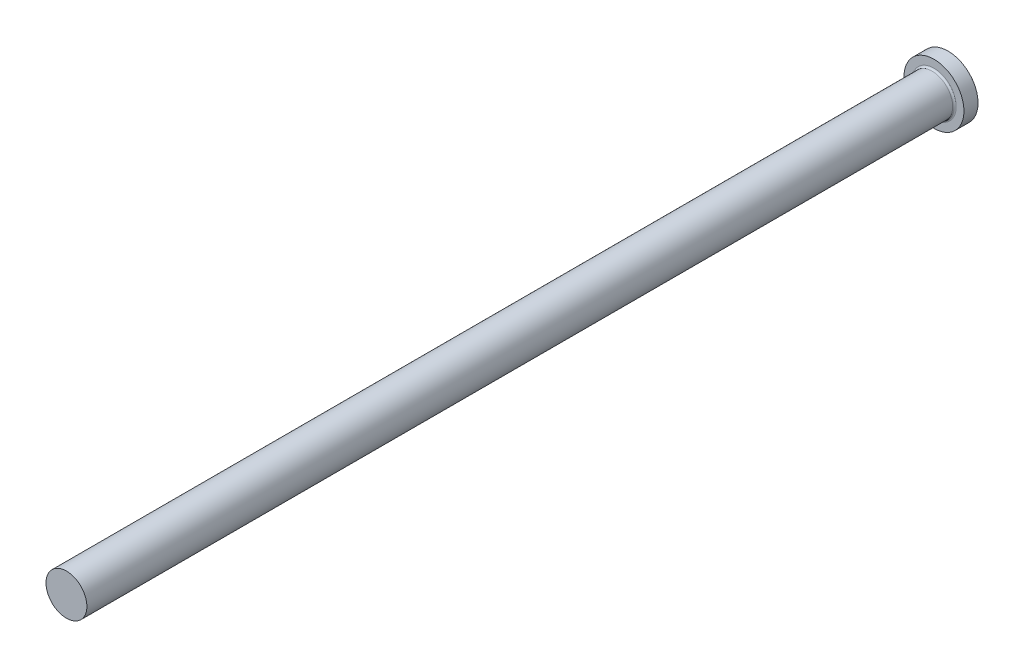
from build123d import *

# Parameters (mm, degrees)
FILLET1_R = 0.5


with BuildPart() as part:
    # FV → Revolve1 (revolve)
    with BuildSketch(Plane(origin=(0, 0, 0), x_dir=(1, 0, 0), z_dir=(0, 1, 0)), mode=Mode.PRIVATE) as revolve1_sk:
        Polygon((0, 0), (8.5, 0), (8.5, -4), (5.8, -4), (5.8, -250), (0, -250), align=None)
    revolve(revolve1_sk.sketch.rotate(Axis((0, 0, -9.033228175), (0, 0, 1)), 180), axis=Axis((0, 0, -9.033228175), (0, 0, 1)))

    # Fillet1
    fillet1_edges = [part.edges().sort_by_distance(p)[0] for p in [
        (5.8, 0, 4),
    ]]
    fillet(fillet1_edges, radius=FILLET1_R)


solid = part.part
